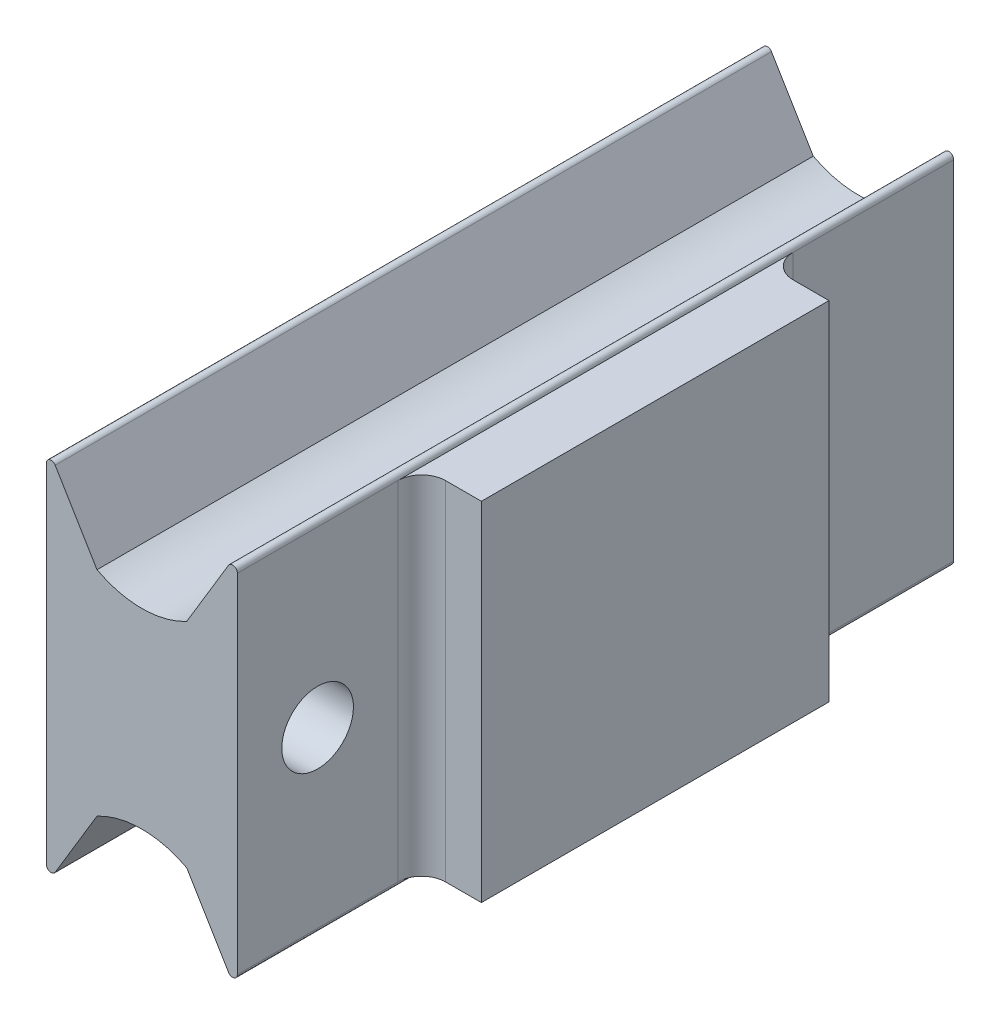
from build123d import *

# Parameters (mm, degrees)
AUFSATZ_LINEAR_AUSTRAGEN1_DEPTH = 15
VERRUNDUNG1_R                   = 0.2
SKIZZE2_W                       = 14.557646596
SKIZZE2_H                       = 14.557646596
AUFSATZ_LINEAR_AUSTRAGEN2_DEPTH = 2.5
VERRUNDUNG2_R                   = 1
SKIZZE3_R                       = 1.5
SCHNITT_LINEAR_AUSTRAGEN1_DEPTH = 12.5
SCHNITT_LINEAR_START            = -1.2
SKIZZE5_R                       = 3.25
SKIZZE5_R_2                     = 1.65
SCHNITT_LINEAR_AUSTRAGEN2_DEPTH = 4.2
SKIZZE5_4_R                     = 1.65
SCHNITT_LINEAR_AUSTRAGEN3_DEPTH = 5.4


with BuildPart() as part:
    # Skizze1 → Aufsatz-Linear austragen1 (new, symmetric)
    with BuildSketch(Plane.XY):
        with BuildLine():
            ThreePointArc((4, -8), (0, -4), (-4, -8))
            Line((-4, -8), (-4, 8))
            ThreePointArc((-4, 8), (0, 4), (4, 8))
            Line((4, 8), (4, -8))
        make_face()
        with BuildLine():
            ThreePointArc((-1.877886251, -4.468209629), (-3.428669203, -5.9398477), (-4, -8))
            Line((-4, -8), (-1.877886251, -4.468209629))
        make_face()
        with BuildLine():
            Line((1.877886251, -4.468209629), (4, -8))
            ThreePointArc((4, -8), (3.428669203, -5.9398477), (1.877886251, -4.468209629))
        make_face()
        with BuildLine():
            ThreePointArc((1.877886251, 4.468209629), (3.428669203, 5.9398477), (4, 8))
            Line((4, 8), (1.877886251, 4.468209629))
        make_face()
        with BuildLine():
            Line((-1.877886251, 4.468209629), (-4, 8))
            ThreePointArc((-4, 8), (-3.428669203, 5.9398477), (-1.877886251, 4.468209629))
        make_face()
    extrude(amount=AUFSATZ_LINEAR_AUSTRAGEN1_DEPTH, both=True)

    # Verrundung1
    verrundung1_edges = [part.edges().sort_by_distance(p)[0] for p in [
        (-4, -8, 0),
        (-4, 8, 0),
        (4, 8, 0),
        (4, -8, 0),
    ]]
    fillet(verrundung1_edges, radius=VERRUNDUNG1_R)

    # Skizze2 → Aufsatz-Linear austragen2 (add)
    with BuildSketch(Plane(origin=(4, 0, 0), x_dir=(0, 0, -1), z_dir=(1, 0, 0))):
        Rectangle(SKIZZE2_W, SKIZZE2_H)
    extrude(amount=AUFSATZ_LINEAR_AUSTRAGEN2_DEPTH)

    # Verrundung2
    verrundung2_edges = [part.edges().sort_by_distance(p)[0] for p in [
        (4, 0, -7.278823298),
        (4, 0, 7.278823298),
    ]]
    fillet(verrundung2_edges, radius=VERRUNDUNG2_R)

    # Skizze3 → Schnitt-Linear austragen1 (cut)
    with BuildSketch(Plane(origin=(4, 0, 0), x_dir=(0, 0, -1), z_dir=(1, 0, 0))):
        with Locations(Location((-11.639411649, 0, 0), (0, 0, 90))):
            Circle(SKIZZE3_R)
    extrude(amount=-SCHNITT_LINEAR_AUSTRAGEN1_DEPTH, mode=Mode.SUBTRACT)

    # Skizze5 → Schnitt-Linear austragen2 (cut)
    with BuildSketch(Plane(origin=(0, 0, -15), x_dir=(-1, 0, 0), z_dir=(0, 0, -1)).offset(SCHNITT_LINEAR_START)):
        Circle(SKIZZE5_R)
        with BuildLine():
            ThreePointArc((3.25, 0), (2.298097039, -2.298097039), (0, -3.25))
            Line((0, -3.25), (4, -3.25))
            Line((4, -3.25), (4, 3.25))
            Line((4, 3.25), (0, 3.25))
            ThreePointArc((0, 3.25), (2.298097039, 2.298097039), (3.25, 0))
        make_face()
        Circle(SKIZZE5_R_2)
    extrude(amount=-SCHNITT_LINEAR_AUSTRAGEN2_DEPTH, mode=Mode.SUBTRACT)

    # Skizze5_4 → Schnitt-Linear austragen3 (cut)
    with BuildSketch(Plane(origin=(0, 0, -15), x_dir=(-1, 0, 0), z_dir=(0, 0, -1))):
        Circle(SKIZZE5_4_R)
    extrude(amount=-SCHNITT_LINEAR_AUSTRAGEN3_DEPTH, mode=Mode.SUBTRACT)


solid = part.part
